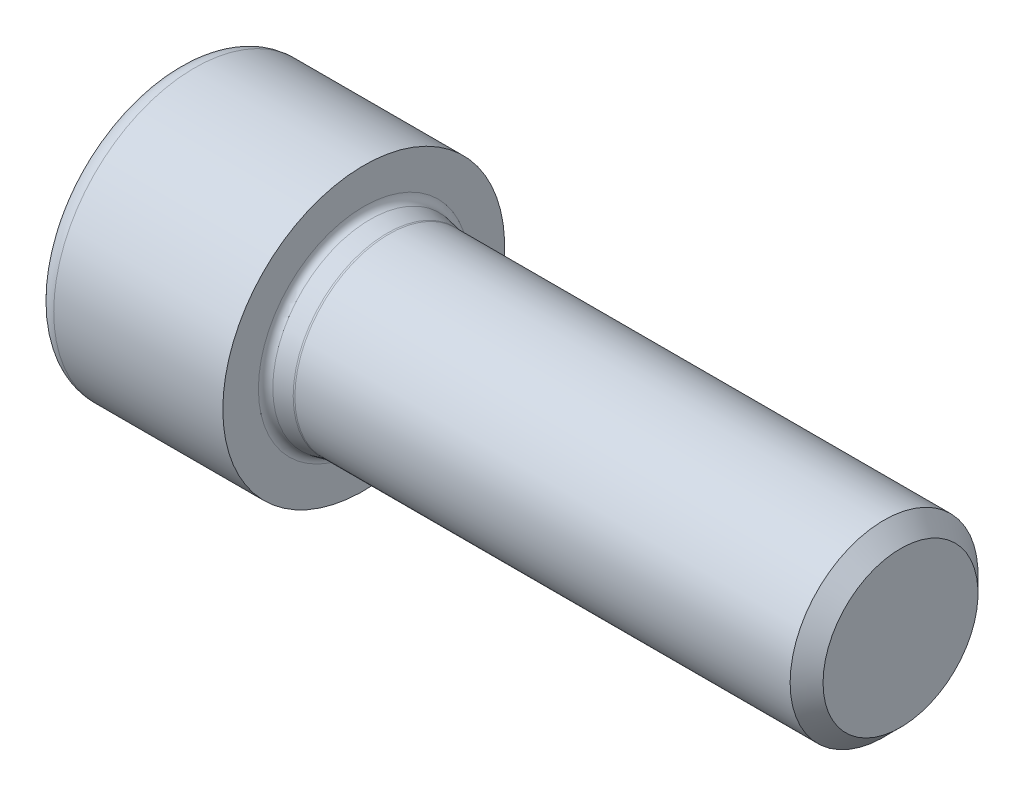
from build123d import *

# Parameters (mm, degrees)
SCHNITT_LINEAR_AUSTRAGEN1_DEPTH = 14


with BuildPart() as part:
    # Skizze1 → Rotation1 (revolve)
    with BuildSketch(Plane(origin=(0, 0, 0), x_dir=(-1, 0, 0), z_dir=(0, 1, 0)), mode=Mode.PRIVATE) as rotation1_sk:
        with BuildLine():
            Line((2.335898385, 0), (5.8, -6))
            Line((5.8, -6), (13.14, -6))
            Line((13.14, -6), (14, -6.86))
            Line((14, -6.86), (14, -9.1))
            ThreePointArc((14, -9.1), (13.589949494, -10.089949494), (12.6, -10.5))
            Line((12.6, -10.5), (0, -10.5))
            Line((0, -10.5), (0, -7.85))
            ThreePointArc((0, -7.85), (-0.136571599, -7.468904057), (-0.484113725, -7.261297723))
            Line((-0.484113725, -7.261297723), (-1.754113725, -7.011297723))
            ThreePointArc((-1.754113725, -7.011297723), (-1.811782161, -7.00283111), (-1.87, -7))
            Line((-1.87, -7), (-38.773, -7))
            Line((-38.773, -7), (-40, -5.773))
            Line((-40, -5.773), (-40, 0))
            Line((-40, 0), (2.335898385, 0))
        make_face()
    revolve(rotation1_sk.sketch.rotate(Axis((40, 0, 0), (-1, 0, 0)), 180), axis=Axis((40, 0, 0), (-1, 0, 0)))

    # Skizze2 → Schnitt-Linear austragen1 (cut)
    with BuildSketch(Plane(origin=(-5.8, 0, 0), x_dir=(0, 0, -1), z_dir=(1, 0, 0))):
        Polygon((-6, 3.464101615), (-6, -3.464101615), (0, -6.92820323), (6, -3.464101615), (6, 3.464101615), (0, 6.92820323), align=None)
    extrude(amount=-SCHNITT_LINEAR_AUSTRAGEN1_DEPTH, mode=Mode.SUBTRACT)


solid = part.part
